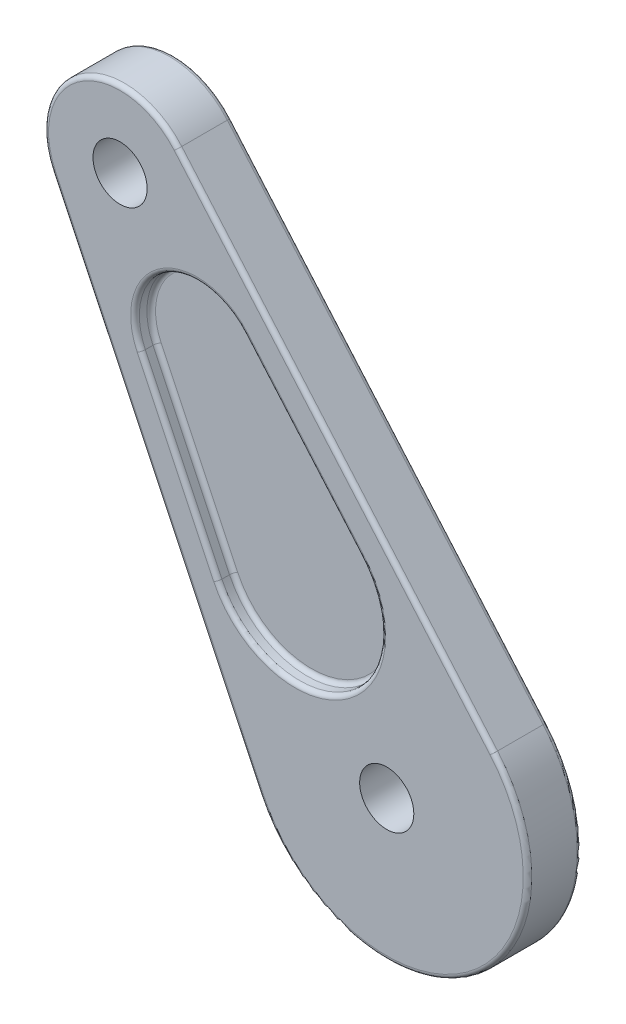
ISO-10303-21;
HEADER;
FILE_DESCRIPTION(('STEP AP214'),'2;1');
FILE_NAME('part.step','',(''),(''),'','','');
FILE_SCHEMA(('AUTOMOTIVE_DESIGN { 1 0 10303 214 1 1 1 1 }'));
ENDSEC;
DATA;
#1=APPLICATION_CONTEXT('core data for automotive mechanical design processes');
#2=APPLICATION_PROTOCOL_DEFINITION('international standard','automotive_design',2000,#1);
#3=PRODUCT_CONTEXT('',#1,'mechanical');
#4=PRODUCT('Part','Part','',(#3));
#5=PRODUCT_RELATED_PRODUCT_CATEGORY('part','',(#4));
#6=PRODUCT_DEFINITION_FORMATION('','',#4);
#7=PRODUCT_DEFINITION_CONTEXT('part definition',#1,'design');
#8=PRODUCT_DEFINITION('design','',#6,#7);
#9=PRODUCT_DEFINITION_SHAPE('','',#8);
#10=(LENGTH_UNIT() NAMED_UNIT(*) SI_UNIT(.MILLI.,.METRE.));
#11=(NAMED_UNIT(*) PLANE_ANGLE_UNIT() SI_UNIT($,.RADIAN.));
#12=(NAMED_UNIT(*) SI_UNIT($,.STERADIAN.) SOLID_ANGLE_UNIT());
#13=UNCERTAINTY_MEASURE_WITH_UNIT(LENGTH_MEASURE(1.E-05),#10,'distance_accuracy_value','');
#14=(GEOMETRIC_REPRESENTATION_CONTEXT(3) GLOBAL_UNCERTAINTY_ASSIGNED_CONTEXT((#13)) GLOBAL_UNIT_ASSIGNED_CONTEXT((#10,
#11,#12)) REPRESENTATION_CONTEXT('',''));
#15=CARTESIAN_POINT('',(0.,0.,0.));
#16=DIRECTION('',(0.,0.,1.));
#17=DIRECTION('',(1.,0.,0.));
#18=AXIS2_PLACEMENT_3D('',#15,#16,#17);
#19=CARTESIAN_POINT('',(-123.08554834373,188.347943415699,-12.5));
#20=DIRECTION('',(0.,0.,1.));
#21=DIRECTION('',(1.,0.,0.));
#22=AXIS2_PLACEMENT_3D('',#19,#20,#21);
#23=PLANE('',#22);
#24=CARTESIAN_POINT('',(-87.5275010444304,133.93631531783,-12.5));
#25=DIRECTION('',(0.,0.,1.));
#26=DIRECTION('',(1.,0.,0.));
#27=AXIS2_PLACEMENT_3D('',#24,#25,#26);
#28=CIRCLE('',#27,30.6666666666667);
#29=CARTESIAN_POINT('',(-64.3223989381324,153.985446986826,-12.5));
#30=VERTEX_POINT('',#29);
#31=CARTESIAN_POINT('',(-115.206230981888,120.732817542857,-12.5));
#32=VERTEX_POINT('',#31);
#33=EDGE_CURVE('E256',#30,#32,#28,.T.);
#34=ORIENTED_EDGE('',*,*,#33,.T.);
#35=DIRECTION('',(0.430548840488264,-0.902567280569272,0.));
#36=VECTOR('',#35,1.);
#37=CARTESIAN_POINT('',(-79.8776019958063,46.6727769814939,-12.5));
#38=LINE('',#37,#36);
#39=CARTESIAN_POINT('',(-79.8776019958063,46.6727769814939,-12.5));
#40=VERTEX_POINT('',#39);
#41=EDGE_CURVE('E258',#32,#40,#38,.T.);
#42=ORIENTED_EDGE('',*,*,#41,.T.);
#43=CARTESIAN_POINT('',(-42.2352371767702,64.6291962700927,-12.5));
#44=DIRECTION('',(0.,0.,1.));
#45=DIRECTION('',(1.,0.,0.));
#46=AXIS2_PLACEMENT_3D('',#43,#44,#45);
#47=CIRCLE('',#46,41.7058823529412);
#48=CARTESIAN_POINT('',(-10.6768917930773,91.8955025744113,-12.5));
#49=VERTEX_POINT('',#48);
#50=EDGE_CURVE('E252',#40,#49,#47,.T.);
#51=ORIENTED_EDGE('',*,*,#50,.T.);
#52=DIRECTION('',(-0.653776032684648,0.756688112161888,0.));
#53=VECTOR('',#52,1.);
#54=CARTESIAN_POINT('',(-64.3223989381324,153.985446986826,-12.5));
#55=LINE('',#54,#53);
#56=EDGE_CURVE('E254',#49,#30,#55,.T.);
#57=ORIENTED_EDGE('',*,*,#56,.T.);
#58=EDGE_LOOP('',(#34,#42,#51,#57));
#59=FACE_BOUND('',#58,.T.);
#60=CARTESIAN_POINT('',(-123.08554834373,188.347943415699,-12.5));
#61=DIRECTION('',(0.,0.,1.));
#62=DIRECTION('',(1.,0.,0.));
#63=AXIS2_PLACEMENT_3D('',#60,#61,#62);
#64=CIRCLE('',#63,12.5);
#65=CARTESIAN_POINT('',(-110.58554834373,188.347943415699,-12.5));
#66=VERTEX_POINT('',#65);
#67=EDGE_CURVE('E391',#66,#66,#64,.T.);
#68=ORIENTED_EDGE('',*,*,#67,.T.);
#69=EDGE_LOOP('',(#68));
#70=FACE_BOUND('',#69,.T.);
#71=CARTESIAN_POINT('',(0.,0.,-12.5));
#72=DIRECTION('',(0.,0.,1.));
#73=DIRECTION('',(1.,0.,0.));
#74=AXIS2_PLACEMENT_3D('',#71,#72,#73);
#75=CIRCLE('',#74,12.5);
#76=CARTESIAN_POINT('',(12.5,0.,-12.5));
#77=VERTEX_POINT('',#76);
#78=EDGE_CURVE('E390',#77,#77,#75,.T.);
#79=ORIENTED_EDGE('',*,*,#78,.T.);
#80=EDGE_LOOP('',(#79));
#81=FACE_BOUND('',#80,.T.);
#82=DIRECTION('',(-0.653776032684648,0.756688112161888,0.));
#83=VECTOR('',#82,1.);
#84=CARTESIAN_POINT('',(-98.1148406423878,209.922552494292,-12.5));
#85=LINE('',#84,#83);
#86=CARTESIAN_POINT('',(-98.1148406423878,209.922552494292,-12.5));
#87=VERTEX_POINT('',#86);
#88=CARTESIAN_POINT('',(47.671351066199,41.1878900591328,-12.5));
#89=VERTEX_POINT('',#88);
#90=EDGE_CURVE('E404',#87,#89,#85,.F.);
#91=ORIENTED_EDGE('',*,*,#90,.T.);
#92=CARTESIAN_POINT('',(0.,0.,-12.5));
#93=DIRECTION('',(0.,0.,1.));
#94=DIRECTION('',(1.,0.,0.));
#95=AXIS2_PLACEMENT_3D('',#92,#93,#94);
#96=CIRCLE('',#95,63.);
#97=CARTESIAN_POINT('',(-56.8617386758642,-27.1245769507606,-12.5));
#98=VERTEX_POINT('',#97);
#99=EDGE_CURVE('E410',#89,#98,#96,.F.);
#100=ORIENTED_EDGE('',*,*,#99,.T.);
#101=DIRECTION('',(0.430548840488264,-0.902567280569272,0.));
#102=VECTOR('',#101,1.);
#103=CARTESIAN_POINT('',(-152.870268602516,174.139831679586,-12.5));
#104=LINE('',#103,#102);
#105=CARTESIAN_POINT('',(-152.870268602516,174.139831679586,-12.5));
#106=VERTEX_POINT('',#105);
#107=EDGE_CURVE('E408',#98,#106,#104,.F.);
#108=ORIENTED_EDGE('',*,*,#107,.T.);
#109=CARTESIAN_POINT('',(-123.08554834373,188.347943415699,-12.5));
#110=DIRECTION('',(0.,0.,1.));
#111=DIRECTION('',(1.,0.,0.));
#112=AXIS2_PLACEMENT_3D('',#109,#110,#111);
#113=CIRCLE('',#112,33.);
#114=EDGE_CURVE('E406',#106,#87,#113,.F.);
#115=ORIENTED_EDGE('',*,*,#114,.T.);
#116=EDGE_LOOP('',(#91,#100,#108,#115));
#117=FACE_BOUND('',#116,.T.);
#118=ADVANCED_FACE('F34',(#59,#70,#81,#117),#23,.F.);
#119=CARTESIAN_POINT('',(-123.08554834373,188.347943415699,12.5));
#120=DIRECTION('',(0.,0.,1.));
#121=DIRECTION('',(1.,0.,0.));
#122=AXIS2_PLACEMENT_3D('',#119,#120,#121);
#123=PLANE('',#122);
#124=CARTESIAN_POINT('',(-42.2352371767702,64.6291962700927,12.5));
#125=DIRECTION('',(0.,0.,1.));
#126=DIRECTION('',(1.,0.,0.));
#127=AXIS2_PLACEMENT_3D('',#124,#125,#126);
#128=CIRCLE('',#127,41.7058823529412);
#129=CARTESIAN_POINT('',(-10.6768917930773,91.8955025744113,12.5));
#130=VERTEX_POINT('',#129);
#131=CARTESIAN_POINT('',(-79.8776019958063,46.6727769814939,12.5));
#132=VERTEX_POINT('',#131);
#133=EDGE_CURVE('E288',#130,#132,#128,.F.);
#134=ORIENTED_EDGE('',*,*,#133,.T.);
#135=DIRECTION('',(0.430548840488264,-0.902567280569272,0.));
#136=VECTOR('',#135,1.);
#137=CARTESIAN_POINT('',(-115.206230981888,120.732817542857,12.5));
#138=LINE('',#137,#136);
#139=CARTESIAN_POINT('',(-115.206230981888,120.732817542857,12.5));
#140=VERTEX_POINT('',#139);
#141=EDGE_CURVE('E290',#132,#140,#138,.F.);
#142=ORIENTED_EDGE('',*,*,#141,.T.);
#143=CARTESIAN_POINT('',(-87.5275010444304,133.93631531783,12.5));
#144=DIRECTION('',(0.,0.,1.));
#145=DIRECTION('',(1.,0.,0.));
#146=AXIS2_PLACEMENT_3D('',#143,#144,#145);
#147=CIRCLE('',#146,30.6666666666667);
#148=CARTESIAN_POINT('',(-64.3223989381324,153.985446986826,12.5));
#149=VERTEX_POINT('',#148);
#150=EDGE_CURVE('E284',#140,#149,#147,.F.);
#151=ORIENTED_EDGE('',*,*,#150,.T.);
#152=DIRECTION('',(-0.653776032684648,0.756688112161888,0.));
#153=VECTOR('',#152,1.);
#154=CARTESIAN_POINT('',(-10.6768917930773,91.8955025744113,12.5));
#155=LINE('',#154,#153);
#156=EDGE_CURVE('E286',#149,#130,#155,.F.);
#157=ORIENTED_EDGE('',*,*,#156,.T.);
#158=EDGE_LOOP('',(#134,#142,#151,#157));
#159=FACE_BOUND('',#158,.T.);
#160=DIRECTION('',(0.430548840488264,-0.902567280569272,0.));
#161=VECTOR('',#160,1.);
#162=CARTESIAN_POINT('',(-56.8617386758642,-27.1245769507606,12.5));
#163=LINE('',#162,#161);
#164=CARTESIAN_POINT('',(-152.870268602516,174.139831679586,12.5));
#165=VERTEX_POINT('',#164);
#166=CARTESIAN_POINT('',(-56.8617386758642,-27.1245769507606,12.5));
#167=VERTEX_POINT('',#166);
#168=EDGE_CURVE('E424',#165,#167,#163,.T.);
#169=ORIENTED_EDGE('',*,*,#168,.T.);
#170=CARTESIAN_POINT('',(0.,0.,12.5));
#171=DIRECTION('',(0.,0.,1.));
#172=DIRECTION('',(1.,0.,0.));
#173=AXIS2_PLACEMENT_3D('',#170,#171,#172);
#174=CIRCLE('',#173,63.);
#175=CARTESIAN_POINT('',(47.671351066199,41.1878900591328,12.5));
#176=VERTEX_POINT('',#175);
#177=EDGE_CURVE('E209',#167,#176,#174,.T.);
#178=ORIENTED_EDGE('',*,*,#177,.T.);
#179=DIRECTION('',(-0.653776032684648,0.756688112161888,0.));
#180=VECTOR('',#179,1.);
#181=CARTESIAN_POINT('',(-98.1148406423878,209.922552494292,12.5));
#182=LINE('',#181,#180);
#183=CARTESIAN_POINT('',(-98.1148406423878,209.922552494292,12.5));
#184=VERTEX_POINT('',#183);
#185=EDGE_CURVE('E234',#176,#184,#182,.T.);
#186=ORIENTED_EDGE('',*,*,#185,.T.);
#187=CARTESIAN_POINT('',(-123.08554834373,188.347943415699,12.5));
#188=DIRECTION('',(0.,0.,1.));
#189=DIRECTION('',(1.,0.,0.));
#190=AXIS2_PLACEMENT_3D('',#187,#188,#189);
#191=CIRCLE('',#190,33.);
#192=EDGE_CURVE('E422',#184,#165,#191,.T.);
#193=ORIENTED_EDGE('',*,*,#192,.T.);
#194=EDGE_LOOP('',(#169,#178,#186,#193));
#195=FACE_BOUND('',#194,.T.);
#196=CARTESIAN_POINT('',(0.,0.,12.5));
#197=DIRECTION('',(0.,0.,1.));
#198=DIRECTION('',(1.,0.,0.));
#199=AXIS2_PLACEMENT_3D('',#196,#197,#198);
#200=CIRCLE('',#199,12.5);
#201=CARTESIAN_POINT('',(12.5,0.,12.5));
#202=VERTEX_POINT('',#201);
#203=EDGE_CURVE('E394',#202,#202,#200,.T.);
#204=ORIENTED_EDGE('',*,*,#203,.F.);
#205=EDGE_LOOP('',(#204));
#206=FACE_BOUND('',#205,.T.);
#207=CARTESIAN_POINT('',(-123.08554834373,188.347943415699,12.5));
#208=DIRECTION('',(0.,0.,1.));
#209=DIRECTION('',(1.,0.,0.));
#210=AXIS2_PLACEMENT_3D('',#207,#208,#209);
#211=CIRCLE('',#210,12.5);
#212=CARTESIAN_POINT('',(-110.58554834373,188.347943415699,12.5));
#213=VERTEX_POINT('',#212);
#214=EDGE_CURVE('E387',#213,#213,#211,.T.);
#215=ORIENTED_EDGE('',*,*,#214,.F.);
#216=EDGE_LOOP('',(#215));
#217=FACE_BOUND('',#216,.T.);
#218=ADVANCED_FACE('F465',(#159,#195,#206,#217),#123,.T.);
#219=CARTESIAN_POINT('',(-123.08554834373,188.347943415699,12.5));
#220=DIRECTION('',(0.,0.,-1.));
#221=DIRECTION('',(-1.,0.,0.));
#222=AXIS2_PLACEMENT_3D('',#219,#220,#221);
#223=CYLINDRICAL_SURFACE('',#222,35.);
#224=DIRECTION('',(0.,0.,-1.));
#225=VECTOR('',#224,1.);
#226=CARTESIAN_POINT('',(-96.6014644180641,211.230104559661,12.5));
#227=LINE('',#226,#225);
#228=CARTESIAN_POINT('',(-96.6014644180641,211.230104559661,10.5));
#229=VERTEX_POINT('',#228);
#230=CARTESIAN_POINT('',(-96.6014644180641,211.230104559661,-10.5));
#231=VERTEX_POINT('',#230);
#232=EDGE_CURVE('E203',#229,#231,#227,.T.);
#233=ORIENTED_EDGE('',*,*,#232,.T.);
#234=CARTESIAN_POINT('',(-123.08554834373,188.347943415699,-10.5));
#235=DIRECTION('',(0.,0.,1.));
#236=DIRECTION('',(1.,0.,0.));
#237=AXIS2_PLACEMENT_3D('',#234,#235,#236);
#238=CIRCLE('',#237,35.);
#239=CARTESIAN_POINT('',(-154.675403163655,173.278733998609,-10.5));
#240=VERTEX_POINT('',#239);
#241=EDGE_CURVE('E419',#231,#240,#238,.T.);
#242=ORIENTED_EDGE('',*,*,#241,.T.);
#243=DIRECTION('',(0.,0.,-1.));
#244=VECTOR('',#243,1.);
#245=CARTESIAN_POINT('',(-154.675403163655,173.278733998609,12.5));
#246=LINE('',#245,#244);
#247=CARTESIAN_POINT('',(-154.675403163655,173.278733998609,10.5));
#248=VERTEX_POINT('',#247);
#249=EDGE_CURVE('E231',#248,#240,#246,.T.);
#250=ORIENTED_EDGE('',*,*,#249,.F.);
#251=CARTESIAN_POINT('',(-123.08554834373,188.347943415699,10.5));
#252=DIRECTION('',(0.,0.,1.));
#253=DIRECTION('',(1.,0.,0.));
#254=AXIS2_PLACEMENT_3D('',#251,#252,#253);
#255=CIRCLE('',#254,35.);
#256=EDGE_CURVE('E417',#248,#229,#255,.F.);
#257=ORIENTED_EDGE('',*,*,#256,.T.);
#258=EDGE_LOOP('',(#233,#242,#250,#257));
#259=FACE_BOUND('',#258,.T.);
#260=ADVANCED_FACE('F454',(#259),#223,.T.);
#261=CARTESIAN_POINT('',(-154.675403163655,173.278733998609,12.5));
#262=DIRECTION('',(0.902567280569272,0.430548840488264,0.));
#263=DIRECTION('',(-0.430548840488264,0.902567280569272,0.));
#264=AXIS2_PLACEMENT_3D('',#261,#262,#263);
#265=PLANE('',#264);
#266=ORIENTED_EDGE('',*,*,#249,.T.);
#267=DIRECTION('',(0.430548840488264,-0.902567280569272,0.));
#268=VECTOR('',#267,1.);
#269=CARTESIAN_POINT('',(-154.675403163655,173.278733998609,-10.5));
#270=LINE('',#269,#268);
#271=CARTESIAN_POINT('',(-58.6668732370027,-27.9856746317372,-10.5));
#272=VERTEX_POINT('',#271);
#273=EDGE_CURVE('E415',#240,#272,#270,.T.);
#274=ORIENTED_EDGE('',*,*,#273,.T.);
#275=DIRECTION('',(0.,0.,-1.));
#276=VECTOR('',#275,1.);
#277=CARTESIAN_POINT('',(-58.6668732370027,-27.9856746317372,12.5));
#278=LINE('',#277,#276);
#279=CARTESIAN_POINT('',(-58.6668732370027,-27.9856746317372,10.5));
#280=VERTEX_POINT('',#279);
#281=EDGE_CURVE('E221',#280,#272,#278,.T.);
#282=ORIENTED_EDGE('',*,*,#281,.F.);
#283=DIRECTION('',(0.430548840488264,-0.902567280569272,0.));
#284=VECTOR('',#283,1.);
#285=CARTESIAN_POINT('',(-154.675403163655,173.278733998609,10.5));
#286=LINE('',#285,#284);
#287=EDGE_CURVE('E413',#280,#248,#286,.F.);
#288=ORIENTED_EDGE('',*,*,#287,.T.);
#289=EDGE_LOOP('',(#266,#274,#282,#288));
#290=FACE_BOUND('',#289,.T.);
#291=ADVANCED_FACE('F498',(#290),#265,.F.);
#292=CARTESIAN_POINT('',(0.,0.,12.5));
#293=DIRECTION('',(0.,0.,-1.));
#294=DIRECTION('',(-1.,0.,0.));
#295=AXIS2_PLACEMENT_3D('',#292,#293,#294);
#296=CYLINDRICAL_SURFACE('',#295,65.);
#297=ORIENTED_EDGE('',*,*,#281,.T.);
#298=CARTESIAN_POINT('',(0.,0.,-10.5));
#299=DIRECTION('',(0.,0.,1.));
#300=DIRECTION('',(1.,0.,0.));
#301=AXIS2_PLACEMENT_3D('',#298,#299,#300);
#302=CIRCLE('',#301,65.);
#303=CARTESIAN_POINT('',(49.1847272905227,42.4954421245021,-10.5));
#304=VERTEX_POINT('',#303);
#305=EDGE_CURVE('E220',#272,#304,#302,.T.);
#306=ORIENTED_EDGE('',*,*,#305,.T.);
#307=DIRECTION('',(0.,0.,-1.));
#308=VECTOR('',#307,1.);
#309=CARTESIAN_POINT('',(49.1847272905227,42.4954421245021,12.5));
#310=LINE('',#309,#308);
#311=CARTESIAN_POINT('',(49.1847272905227,42.4954421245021,10.5));
#312=VERTEX_POINT('',#311);
#313=EDGE_CURVE('E201',#312,#304,#310,.T.);
#314=ORIENTED_EDGE('',*,*,#313,.F.);
#315=CARTESIAN_POINT('',(0.,0.,10.5));
#316=DIRECTION('',(0.,0.,1.));
#317=DIRECTION('',(1.,0.,0.));
#318=AXIS2_PLACEMENT_3D('',#315,#316,#317);
#319=CIRCLE('',#318,65.);
#320=EDGE_CURVE('E217',#312,#280,#319,.F.);
#321=ORIENTED_EDGE('',*,*,#320,.T.);
#322=EDGE_LOOP('',(#297,#306,#314,#321));
#323=FACE_BOUND('',#322,.T.);
#324=ADVANCED_FACE('F216',(#323),#296,.T.);
#325=CARTESIAN_POINT('',(-96.6014644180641,211.230104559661,12.5));
#326=DIRECTION('',(-0.756688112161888,-0.653776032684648,0.));
#327=DIRECTION('',(0.653776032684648,-0.756688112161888,0.));
#328=AXIS2_PLACEMENT_3D('',#325,#326,#327);
#329=PLANE('',#328);
#330=ORIENTED_EDGE('',*,*,#313,.T.);
#331=DIRECTION('',(-0.653776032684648,0.756688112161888,0.));
#332=VECTOR('',#331,1.);
#333=CARTESIAN_POINT('',(-96.6014644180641,211.230104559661,-10.5));
#334=LINE('',#333,#332);
#335=EDGE_CURVE('E208',#304,#231,#334,.T.);
#336=ORIENTED_EDGE('',*,*,#335,.T.);
#337=ORIENTED_EDGE('',*,*,#232,.F.);
#338=DIRECTION('',(-0.653776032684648,0.756688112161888,0.));
#339=VECTOR('',#338,1.);
#340=CARTESIAN_POINT('',(49.1847272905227,42.4954421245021,10.5));
#341=LINE('',#340,#339);
#342=EDGE_CURVE('E198',#229,#312,#341,.F.);
#343=ORIENTED_EDGE('',*,*,#342,.T.);
#344=EDGE_LOOP('',(#330,#336,#337,#343));
#345=FACE_BOUND('',#344,.T.);
#346=ADVANCED_FACE('F200',(#345),#329,.F.);
#347=CARTESIAN_POINT('',(0.,0.,12.5));
#348=DIRECTION('',(0.,0.,-1.));
#349=DIRECTION('',(-1.,0.,0.));
#350=AXIS2_PLACEMENT_3D('',#347,#348,#349);
#351=CYLINDRICAL_SURFACE('',#350,12.5);
#352=ORIENTED_EDGE('',*,*,#203,.T.);
#353=EDGE_LOOP('',(#352));
#354=FACE_BOUND('',#353,.T.);
#355=ORIENTED_EDGE('',*,*,#78,.F.);
#356=EDGE_LOOP('',(#355));
#357=FACE_BOUND('',#356,.T.);
#358=ADVANCED_FACE('F477',(#354,#357),#351,.F.);
#359=CARTESIAN_POINT('',(-123.08554834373,188.347943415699,12.5));
#360=DIRECTION('',(0.,0.,-1.));
#361=DIRECTION('',(-1.,0.,0.));
#362=AXIS2_PLACEMENT_3D('',#359,#360,#361);
#363=CYLINDRICAL_SURFACE('',#362,12.5);
#364=ORIENTED_EDGE('',*,*,#214,.T.);
#365=EDGE_LOOP('',(#364));
#366=FACE_BOUND('',#365,.T.);
#367=ORIENTED_EDGE('',*,*,#67,.F.);
#368=EDGE_LOOP('',(#367));
#369=FACE_BOUND('',#368,.T.);
#370=ADVANCED_FACE('F474',(#366,#369),#363,.F.);
#371=CARTESIAN_POINT('',(-123.08554834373,188.347943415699,-10.5));
#372=DIRECTION('',(0.,0.,1.));
#373=DIRECTION('',(1.,0.,0.));
#374=AXIS2_PLACEMENT_3D('',#371,#372,#373);
#375=TOROIDAL_SURFACE('',#374,33.,2.);
#376=CARTESIAN_POINT('',(-98.1148406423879,209.922552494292,-10.5));
#377=DIRECTION('',(0.653776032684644,-0.756688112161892,0.));
#378=DIRECTION('',(0.756688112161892,0.653776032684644,0.));
#379=AXIS2_PLACEMENT_3D('',#376,#377,#378);
#380=CIRCLE('',#379,2.);
#381=EDGE_CURVE('E430',#87,#231,#380,.T.);
#382=ORIENTED_EDGE('',*,*,#381,.F.);
#383=ORIENTED_EDGE('',*,*,#114,.F.);
#384=CARTESIAN_POINT('',(-152.870268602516,174.139831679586,-10.5));
#385=DIRECTION('',(0.430548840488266,-0.902567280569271,0.));
#386=DIRECTION('',(0.902567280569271,0.430548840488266,0.));
#387=AXIS2_PLACEMENT_3D('',#384,#385,#386);
#388=CIRCLE('',#387,2.);
#389=EDGE_CURVE('E244',#240,#106,#388,.T.);
#390=ORIENTED_EDGE('',*,*,#389,.F.);
#391=ORIENTED_EDGE('',*,*,#241,.F.);
#392=EDGE_LOOP('',(#382,#383,#390,#391));
#393=FACE_BOUND('',#392,.T.);
#394=ADVANCED_FACE('F446',(#393),#375,.T.);
#395=CARTESIAN_POINT('',(-152.870268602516,174.139831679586,-10.5));
#396=DIRECTION('',(0.430548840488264,-0.902567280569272,0.));
#397=DIRECTION('',(0.902567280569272,0.430548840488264,0.));
#398=AXIS2_PLACEMENT_3D('',#395,#396,#397);
#399=CYLINDRICAL_SURFACE('',#398,2.);
#400=ORIENTED_EDGE('',*,*,#389,.T.);
#401=ORIENTED_EDGE('',*,*,#107,.F.);
#402=CARTESIAN_POINT('',(-56.8617386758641,-27.1245769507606,-10.5));
#403=DIRECTION('',(0.430548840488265,-0.902567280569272,0.));
#404=DIRECTION('',(0.902567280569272,0.430548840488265,0.));
#405=AXIS2_PLACEMENT_3D('',#402,#403,#404);
#406=CIRCLE('',#405,2.);
#407=EDGE_CURVE('E429',#272,#98,#406,.T.);
#408=ORIENTED_EDGE('',*,*,#407,.F.);
#409=ORIENTED_EDGE('',*,*,#273,.F.);
#410=EDGE_LOOP('',(#400,#401,#408,#409));
#411=FACE_BOUND('',#410,.T.);
#412=ADVANCED_FACE('F441',(#411),#399,.T.);
#413=CARTESIAN_POINT('',(-98.1148406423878,209.922552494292,-10.5));
#414=DIRECTION('',(-0.653776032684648,0.756688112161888,0.));
#415=DIRECTION('',(-0.756688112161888,-0.653776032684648,0.));
#416=AXIS2_PLACEMENT_3D('',#413,#414,#415);
#417=CYLINDRICAL_SURFACE('',#416,2.);
#418=ORIENTED_EDGE('',*,*,#381,.T.);
#419=ORIENTED_EDGE('',*,*,#335,.F.);
#420=CARTESIAN_POINT('',(47.671351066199,41.1878900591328,-10.5));
#421=DIRECTION('',(0.653776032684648,-0.756688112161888,0.));
#422=DIRECTION('',(0.756688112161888,0.653776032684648,0.));
#423=AXIS2_PLACEMENT_3D('',#420,#421,#422);
#424=CIRCLE('',#423,2.);
#425=EDGE_CURVE('E251',#89,#304,#424,.T.);
#426=ORIENTED_EDGE('',*,*,#425,.F.);
#427=ORIENTED_EDGE('',*,*,#90,.F.);
#428=EDGE_LOOP('',(#418,#419,#426,#427));
#429=FACE_BOUND('',#428,.T.);
#430=ADVANCED_FACE('F452',(#429),#417,.T.);
#431=CARTESIAN_POINT('',(0.,0.,-10.5));
#432=DIRECTION('',(0.,0.,1.));
#433=DIRECTION('',(1.,0.,0.));
#434=AXIS2_PLACEMENT_3D('',#431,#432,#433);
#435=TOROIDAL_SURFACE('',#434,63.,2.);
#436=ORIENTED_EDGE('',*,*,#407,.T.);
#437=ORIENTED_EDGE('',*,*,#99,.F.);
#438=ORIENTED_EDGE('',*,*,#425,.T.);
#439=ORIENTED_EDGE('',*,*,#305,.F.);
#440=EDGE_LOOP('',(#436,#437,#438,#439));
#441=FACE_BOUND('',#440,.T.);
#442=ADVANCED_FACE('F451',(#441),#435,.T.);
#443=CARTESIAN_POINT('',(-123.08554834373,188.347943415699,10.5));
#444=DIRECTION('',(0.,0.,1.));
#445=DIRECTION('',(1.,0.,0.));
#446=AXIS2_PLACEMENT_3D('',#443,#444,#445);
#447=TOROIDAL_SURFACE('',#446,33.,2.);
#448=CARTESIAN_POINT('',(-98.1148406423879,209.922552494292,10.5));
#449=DIRECTION('',(0.653776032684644,-0.756688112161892,0.));
#450=DIRECTION('',(0.756688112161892,0.653776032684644,0.));
#451=AXIS2_PLACEMENT_3D('',#448,#449,#450);
#452=CIRCLE('',#451,2.);
#453=EDGE_CURVE('E238',#229,#184,#452,.T.);
#454=ORIENTED_EDGE('',*,*,#453,.F.);
#455=ORIENTED_EDGE('',*,*,#256,.F.);
#456=CARTESIAN_POINT('',(-152.870268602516,174.139831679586,10.5));
#457=DIRECTION('',(0.430548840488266,-0.902567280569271,0.));
#458=DIRECTION('',(0.902567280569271,0.430548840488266,0.));
#459=AXIS2_PLACEMENT_3D('',#456,#457,#458);
#460=CIRCLE('',#459,2.);
#461=EDGE_CURVE('E248',#165,#248,#460,.T.);
#462=ORIENTED_EDGE('',*,*,#461,.F.);
#463=ORIENTED_EDGE('',*,*,#192,.F.);
#464=EDGE_LOOP('',(#454,#455,#462,#463));
#465=FACE_BOUND('',#464,.T.);
#466=ADVANCED_FACE('F459',(#465),#447,.T.);
#467=CARTESIAN_POINT('',(-152.870268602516,174.139831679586,10.5));
#468=DIRECTION('',(-0.430548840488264,0.902567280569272,0.));
#469=DIRECTION('',(-0.902567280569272,-0.430548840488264,0.));
#470=AXIS2_PLACEMENT_3D('',#467,#468,#469);
#471=CYLINDRICAL_SURFACE('',#470,2.);
#472=ORIENTED_EDGE('',*,*,#461,.T.);
#473=ORIENTED_EDGE('',*,*,#287,.F.);
#474=CARTESIAN_POINT('',(-56.8617386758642,-27.1245769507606,10.5));
#475=DIRECTION('',(0.430548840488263,-0.902567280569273,0.));
#476=DIRECTION('',(0.902567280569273,0.430548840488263,0.));
#477=AXIS2_PLACEMENT_3D('',#474,#475,#476);
#478=CIRCLE('',#477,2.);
#479=EDGE_CURVE('E229',#167,#280,#478,.T.);
#480=ORIENTED_EDGE('',*,*,#479,.F.);
#481=ORIENTED_EDGE('',*,*,#168,.F.);
#482=EDGE_LOOP('',(#472,#473,#480,#481));
#483=FACE_BOUND('',#482,.T.);
#484=ADVANCED_FACE('F463',(#483),#471,.T.);
#485=CARTESIAN_POINT('',(-98.1148406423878,209.922552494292,10.5));
#486=DIRECTION('',(0.653776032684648,-0.756688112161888,0.));
#487=DIRECTION('',(0.756688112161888,0.653776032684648,0.));
#488=AXIS2_PLACEMENT_3D('',#485,#486,#487);
#489=CYLINDRICAL_SURFACE('',#488,2.);
#490=ORIENTED_EDGE('',*,*,#453,.T.);
#491=ORIENTED_EDGE('',*,*,#185,.F.);
#492=CARTESIAN_POINT('',(47.671351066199,41.1878900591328,10.5));
#493=DIRECTION('',(0.653776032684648,-0.756688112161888,0.));
#494=DIRECTION('',(0.756688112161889,0.653776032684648,0.));
#495=AXIS2_PLACEMENT_3D('',#492,#493,#494);
#496=CIRCLE('',#495,2.);
#497=EDGE_CURVE('E226',#312,#176,#496,.T.);
#498=ORIENTED_EDGE('',*,*,#497,.F.);
#499=ORIENTED_EDGE('',*,*,#342,.F.);
#500=EDGE_LOOP('',(#490,#491,#498,#499));
#501=FACE_BOUND('',#500,.T.);
#502=ADVANCED_FACE('F233',(#501),#489,.T.);
#503=CARTESIAN_POINT('',(0.,0.,10.5));
#504=DIRECTION('',(0.,0.,1.));
#505=DIRECTION('',(1.,0.,0.));
#506=AXIS2_PLACEMENT_3D('',#503,#504,#505);
#507=TOROIDAL_SURFACE('',#506,63.,2.);
#508=ORIENTED_EDGE('',*,*,#479,.T.);
#509=ORIENTED_EDGE('',*,*,#320,.F.);
#510=ORIENTED_EDGE('',*,*,#497,.T.);
#511=ORIENTED_EDGE('',*,*,#177,.F.);
#512=EDGE_LOOP('',(#508,#509,#510,#511));
#513=FACE_BOUND('',#512,.T.);
#514=ADVANCED_FACE('F224',(#513),#507,.T.);
#515=CARTESIAN_POINT('',(24.0308841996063,-166.507218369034,5.));
#516=DIRECTION('',(-0.902567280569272,-0.430548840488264,0.));
#517=DIRECTION('',(0.430548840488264,-0.902567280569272,0.));
#518=AXIS2_PLACEMENT_3D('',#515,#516,#517);
#519=PLANE('',#518);
#520=DIRECTION('',(0.,0.,1.));
#521=VECTOR('',#520,1.);
#522=CARTESIAN_POINT('',(-113.40109642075,121.593915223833,5.));
#523=LINE('',#522,#521);
#524=CARTESIAN_POINT('',(-113.40109642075,121.593915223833,7.));
#525=VERTEX_POINT('',#524);
#526=CARTESIAN_POINT('',(-113.40109642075,121.593915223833,10.5));
#527=VERTEX_POINT('',#526);
#528=EDGE_CURVE('E236',#525,#527,#523,.T.);
#529=ORIENTED_EDGE('',*,*,#528,.T.);
#530=DIRECTION('',(0.430548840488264,-0.902567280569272,0.));
#531=VECTOR('',#530,1.);
#532=CARTESIAN_POINT('',(-78.0724674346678,47.5338746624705,10.5));
#533=LINE('',#532,#531);
#534=CARTESIAN_POINT('',(-78.0724674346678,47.5338746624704,10.5));
#535=VERTEX_POINT('',#534);
#536=EDGE_CURVE('E281',#527,#535,#533,.T.);
#537=ORIENTED_EDGE('',*,*,#536,.T.);
#538=DIRECTION('',(0.,0.,1.));
#539=VECTOR('',#538,1.);
#540=CARTESIAN_POINT('',(-78.0724674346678,47.5338746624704,5.));
#541=LINE('',#540,#539);
#542=CARTESIAN_POINT('',(-78.0724674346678,47.5338746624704,7.));
#543=VERTEX_POINT('',#542);
#544=EDGE_CURVE('E380',#543,#535,#541,.T.);
#545=ORIENTED_EDGE('',*,*,#544,.F.);
#546=DIRECTION('',(0.430548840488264,-0.902567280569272,0.));
#547=VECTOR('',#546,1.);
#548=CARTESIAN_POINT('',(24.0308841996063,-166.507218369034,7.));
#549=LINE('',#548,#547);
#550=EDGE_CURVE('E279',#543,#525,#549,.F.);
#551=ORIENTED_EDGE('',*,*,#550,.T.);
#552=EDGE_LOOP('',(#529,#537,#545,#551));
#553=FACE_BOUND('',#552,.T.);
#554=ADVANCED_FACE('F514',(#553),#519,.F.);
#555=CARTESIAN_POINT('',(-87.5275010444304,133.93631531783,5.));
#556=DIRECTION('',(0.,0.,1.));
#557=DIRECTION('',(1.,0.,0.));
#558=AXIS2_PLACEMENT_3D('',#555,#556,#557);
#559=CYLINDRICAL_SURFACE('',#558,28.6666666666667);
#560=DIRECTION('',(0.,0.,1.));
#561=VECTOR('',#560,1.);
#562=CARTESIAN_POINT('',(-65.8357751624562,152.677894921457,5.));
#563=LINE('',#562,#561);
#564=CARTESIAN_POINT('',(-65.8357751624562,152.677894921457,7.));
#565=VERTEX_POINT('',#564);
#566=CARTESIAN_POINT('',(-65.8357751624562,152.677894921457,10.5));
#567=VERTEX_POINT('',#566);
#568=EDGE_CURVE('E241',#565,#567,#563,.T.);
#569=ORIENTED_EDGE('',*,*,#568,.T.);
#570=CARTESIAN_POINT('',(-87.5275010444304,133.93631531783,10.5));
#571=DIRECTION('',(0.,0.,1.));
#572=DIRECTION('',(1.,0.,0.));
#573=AXIS2_PLACEMENT_3D('',#570,#571,#572);
#574=CIRCLE('',#573,28.6666666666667);
#575=EDGE_CURVE('E304',#567,#527,#574,.T.);
#576=ORIENTED_EDGE('',*,*,#575,.T.);
#577=ORIENTED_EDGE('',*,*,#528,.F.);
#578=CARTESIAN_POINT('',(-87.5275010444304,133.93631531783,7.));
#579=DIRECTION('',(0.,0.,1.));
#580=DIRECTION('',(1.,0.,0.));
#581=AXIS2_PLACEMENT_3D('',#578,#579,#580);
#582=CIRCLE('',#581,28.6666666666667);
#583=EDGE_CURVE('E302',#525,#565,#582,.F.);
#584=ORIENTED_EDGE('',*,*,#583,.T.);
#585=EDGE_LOOP('',(#569,#576,#577,#584));
#586=FACE_BOUND('',#585,.T.);
#587=ADVANCED_FACE('F371',(#586),#559,.F.);
#588=CARTESIAN_POINT('',(116.967319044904,-58.900568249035,5.));
#589=DIRECTION('',(0.756688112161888,0.653776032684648,0.));
#590=DIRECTION('',(-0.653776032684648,0.756688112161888,0.));
#591=AXIS2_PLACEMENT_3D('',#588,#589,#590);
#592=PLANE('',#591);
#593=DIRECTION('',(0.,0.,1.));
#594=VECTOR('',#593,1.);
#595=CARTESIAN_POINT('',(-12.1902680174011,90.587950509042,5.));
#596=LINE('',#595,#594);
#597=CARTESIAN_POINT('',(-12.1902680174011,90.587950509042,7.));
#598=VERTEX_POINT('',#597);
#599=CARTESIAN_POINT('',(-12.1902680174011,90.587950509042,10.5));
#600=VERTEX_POINT('',#599);
#601=EDGE_CURVE('E378',#598,#600,#596,.T.);
#602=ORIENTED_EDGE('',*,*,#601,.T.);
#603=DIRECTION('',(-0.653776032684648,0.756688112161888,0.));
#604=VECTOR('',#603,1.);
#605=CARTESIAN_POINT('',(-65.8357751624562,152.677894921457,10.5));
#606=LINE('',#605,#604);
#607=EDGE_CURVE('E300',#600,#567,#606,.T.);
#608=ORIENTED_EDGE('',*,*,#607,.T.);
#609=ORIENTED_EDGE('',*,*,#568,.F.);
#610=DIRECTION('',(-0.653776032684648,0.756688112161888,0.));
#611=VECTOR('',#610,1.);
#612=CARTESIAN_POINT('',(116.967319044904,-58.900568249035,7.));
#613=LINE('',#612,#611);
#614=EDGE_CURVE('E298',#565,#598,#613,.F.);
#615=ORIENTED_EDGE('',*,*,#614,.T.);
#616=EDGE_LOOP('',(#602,#608,#609,#615));
#617=FACE_BOUND('',#616,.T.);
#618=ADVANCED_FACE('F375',(#617),#592,.F.);
#619=CARTESIAN_POINT('',(-42.2352371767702,64.6291962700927,5.));
#620=DIRECTION('',(0.,0.,1.));
#621=DIRECTION('',(1.,0.,0.));
#622=AXIS2_PLACEMENT_3D('',#619,#620,#621);
#623=CYLINDRICAL_SURFACE('',#622,39.7058823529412);
#624=ORIENTED_EDGE('',*,*,#544,.T.);
#625=CARTESIAN_POINT('',(-42.2352371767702,64.6291962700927,10.5));
#626=DIRECTION('',(0.,0.,1.));
#627=DIRECTION('',(1.,0.,0.));
#628=AXIS2_PLACEMENT_3D('',#625,#626,#627);
#629=CIRCLE('',#628,39.7058823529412);
#630=EDGE_CURVE('E296',#535,#600,#629,.T.);
#631=ORIENTED_EDGE('',*,*,#630,.T.);
#632=ORIENTED_EDGE('',*,*,#601,.F.);
#633=CARTESIAN_POINT('',(-42.2352371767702,64.6291962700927,7.));
#634=DIRECTION('',(0.,0.,1.));
#635=DIRECTION('',(1.,0.,0.));
#636=AXIS2_PLACEMENT_3D('',#633,#634,#635);
#637=CIRCLE('',#636,39.7058823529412);
#638=EDGE_CURVE('E293',#598,#543,#637,.F.);
#639=ORIENTED_EDGE('',*,*,#638,.T.);
#640=EDGE_LOOP('',(#624,#631,#632,#639));
#641=FACE_BOUND('',#640,.T.);
#642=ADVANCED_FACE('F675',(#641),#623,.F.);
#643=CARTESIAN_POINT('',(-46.5427741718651,-200.172749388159,5.));
#644=DIRECTION('',(0.,0.,1.));
#645=DIRECTION('',(1.,0.,0.));
#646=AXIS2_PLACEMENT_3D('',#643,#644,#645);
#647=PLANE('',#646);
#648=DIRECTION('',(0.430548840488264,-0.902567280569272,0.));
#649=VECTOR('',#648,1.);
#650=CARTESIAN_POINT('',(25.8360187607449,-165.646120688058,5.));
#651=LINE('',#650,#649);
#652=CARTESIAN_POINT('',(-111.595961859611,122.45501290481,5.));
#653=VERTEX_POINT('',#652);
#654=CARTESIAN_POINT('',(-76.2673328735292,48.394972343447,5.));
#655=VERTEX_POINT('',#654);
#656=EDGE_CURVE('E315',#653,#655,#651,.T.);
#657=ORIENTED_EDGE('',*,*,#656,.T.);
#658=CARTESIAN_POINT('',(-42.2352371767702,64.6291962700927,5.));
#659=DIRECTION('',(0.,0.,1.));
#660=DIRECTION('',(1.,0.,0.));
#661=AXIS2_PLACEMENT_3D('',#658,#659,#660);
#662=CIRCLE('',#661,37.7058823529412);
#663=CARTESIAN_POINT('',(-13.7036442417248,89.2803984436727,5.));
#664=VERTEX_POINT('',#663);
#665=EDGE_CURVE('E11',#655,#664,#662,.T.);
#666=ORIENTED_EDGE('',*,*,#665,.T.);
#667=DIRECTION('',(-0.653776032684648,0.756688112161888,0.));
#668=VECTOR('',#667,1.);
#669=CARTESIAN_POINT('',(115.45394282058,-60.2081203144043,5.));
#670=LINE('',#669,#668);
#671=CARTESIAN_POINT('',(-67.34915138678,151.370342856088,5.));
#672=VERTEX_POINT('',#671);
#673=EDGE_CURVE('E43',#664,#672,#670,.T.);
#674=ORIENTED_EDGE('',*,*,#673,.T.);
#675=CARTESIAN_POINT('',(-87.5275010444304,133.93631531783,5.));
#676=DIRECTION('',(0.,0.,1.));
#677=DIRECTION('',(1.,0.,0.));
#678=AXIS2_PLACEMENT_3D('',#675,#676,#677);
#679=CIRCLE('',#678,26.6666666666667);
#680=EDGE_CURVE('E317',#672,#653,#679,.T.);
#681=ORIENTED_EDGE('',*,*,#680,.T.);
#682=EDGE_LOOP('',(#657,#666,#674,#681));
#683=FACE_BOUND('',#682,.T.);
#684=ADVANCED_FACE('F667',(#683),#647,.T.);
#685=CARTESIAN_POINT('',(24.0308841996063,-166.507218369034,-5.));
#686=DIRECTION('',(0.902567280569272,0.430548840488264,0.));
#687=DIRECTION('',(-0.430548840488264,0.902567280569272,0.));
#688=AXIS2_PLACEMENT_3D('',#685,#686,#687);
#689=PLANE('',#688);
#690=DIRECTION('',(0.,0.,-1.));
#691=VECTOR('',#690,1.);
#692=CARTESIAN_POINT('',(-78.0724674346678,47.5338746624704,-5.));
#693=LINE('',#692,#691);
#694=CARTESIAN_POINT('',(-78.0724674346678,47.5338746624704,-7.));
#695=VERTEX_POINT('',#694);
#696=CARTESIAN_POINT('',(-78.0724674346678,47.5338746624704,-10.5));
#697=VERTEX_POINT('',#696);
#698=EDGE_CURVE('E386',#695,#697,#693,.T.);
#699=ORIENTED_EDGE('',*,*,#698,.T.);
#700=DIRECTION('',(0.430548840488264,-0.902567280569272,0.));
#701=VECTOR('',#700,1.);
#702=CARTESIAN_POINT('',(-113.40109642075,121.593915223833,-10.5));
#703=LINE('',#702,#701);
#704=CARTESIAN_POINT('',(-113.40109642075,121.593915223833,-10.5));
#705=VERTEX_POINT('',#704);
#706=EDGE_CURVE('E264',#697,#705,#703,.F.);
#707=ORIENTED_EDGE('',*,*,#706,.T.);
#708=DIRECTION('',(0.,0.,-1.));
#709=VECTOR('',#708,1.);
#710=CARTESIAN_POINT('',(-113.40109642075,121.593915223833,-5.));
#711=LINE('',#710,#709);
#712=CARTESIAN_POINT('',(-113.40109642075,121.593915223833,-7.));
#713=VERTEX_POINT('',#712);
#714=EDGE_CURVE('E331',#713,#705,#711,.T.);
#715=ORIENTED_EDGE('',*,*,#714,.F.);
#716=DIRECTION('',(0.430548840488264,-0.902567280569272,0.));
#717=VECTOR('',#716,1.);
#718=CARTESIAN_POINT('',(-78.0724674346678,47.5338746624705,-7.));
#719=LINE('',#718,#717);
#720=EDGE_CURVE('E261',#713,#695,#719,.T.);
#721=ORIENTED_EDGE('',*,*,#720,.T.);
#722=EDGE_LOOP('',(#699,#707,#715,#721));
#723=FACE_BOUND('',#722,.T.);
#724=ADVANCED_FACE('F659',(#723),#689,.T.);
#725=CARTESIAN_POINT('',(-42.2352371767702,64.6291962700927,-5.));
#726=DIRECTION('',(0.,0.,-1.));
#727=DIRECTION('',(-1.,0.,0.));
#728=AXIS2_PLACEMENT_3D('',#725,#726,#727);
#729=CYLINDRICAL_SURFACE('',#728,39.7058823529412);
#730=DIRECTION('',(0.,0.,-1.));
#731=VECTOR('',#730,1.);
#732=CARTESIAN_POINT('',(-12.1902680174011,90.587950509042,-5.));
#733=LINE('',#732,#731);
#734=CARTESIAN_POINT('',(-12.1902680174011,90.587950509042,-7.));
#735=VERTEX_POINT('',#734);
#736=CARTESIAN_POINT('',(-12.1902680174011,90.587950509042,-10.5));
#737=VERTEX_POINT('',#736);
#738=EDGE_CURVE('E882',#735,#737,#733,.T.);
#739=ORIENTED_EDGE('',*,*,#738,.T.);
#740=CARTESIAN_POINT('',(-42.2352371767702,64.6291962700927,-10.5));
#741=DIRECTION('',(0.,0.,1.));
#742=DIRECTION('',(1.,0.,0.));
#743=AXIS2_PLACEMENT_3D('',#740,#741,#742);
#744=CIRCLE('',#743,39.7058823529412);
#745=EDGE_CURVE('E277',#737,#697,#744,.F.);
#746=ORIENTED_EDGE('',*,*,#745,.T.);
#747=ORIENTED_EDGE('',*,*,#698,.F.);
#748=CARTESIAN_POINT('',(-42.2352371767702,64.6291962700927,-7.));
#749=DIRECTION('',(0.,0.,-1.));
#750=DIRECTION('',(-1.,0.,0.));
#751=AXIS2_PLACEMENT_3D('',#748,#749,#750);
#752=CIRCLE('',#751,39.7058823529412);
#753=EDGE_CURVE('E275',#695,#735,#752,.F.);
#754=ORIENTED_EDGE('',*,*,#753,.T.);
#755=EDGE_LOOP('',(#739,#746,#747,#754));
#756=FACE_BOUND('',#755,.T.);
#757=ADVANCED_FACE('F651',(#756),#729,.F.);
#758=CARTESIAN_POINT('',(116.967319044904,-58.900568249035,-5.));
#759=DIRECTION('',(-0.756688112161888,-0.653776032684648,0.));
#760=DIRECTION('',(0.653776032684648,-0.756688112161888,0.));
#761=AXIS2_PLACEMENT_3D('',#758,#759,#760);
#762=PLANE('',#761);
#763=DIRECTION('',(0.,0.,-1.));
#764=VECTOR('',#763,1.);
#765=CARTESIAN_POINT('',(-65.8357751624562,152.677894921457,-5.));
#766=LINE('',#765,#764);
#767=CARTESIAN_POINT('',(-65.8357751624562,152.677894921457,-7.));
#768=VERTEX_POINT('',#767);
#769=CARTESIAN_POINT('',(-65.8357751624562,152.677894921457,-10.5));
#770=VERTEX_POINT('',#769);
#771=EDGE_CURVE('E896',#768,#770,#766,.T.);
#772=ORIENTED_EDGE('',*,*,#771,.T.);
#773=DIRECTION('',(-0.653776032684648,0.756688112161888,0.));
#774=VECTOR('',#773,1.);
#775=CARTESIAN_POINT('',(-12.1902680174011,90.587950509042,-10.5));
#776=LINE('',#775,#774);
#777=EDGE_CURVE('E273',#770,#737,#776,.F.);
#778=ORIENTED_EDGE('',*,*,#777,.T.);
#779=ORIENTED_EDGE('',*,*,#738,.F.);
#780=DIRECTION('',(-0.653776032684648,0.756688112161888,0.));
#781=VECTOR('',#780,1.);
#782=CARTESIAN_POINT('',(-65.8357751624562,152.677894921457,-7.));
#783=LINE('',#782,#781);
#784=EDGE_CURVE('E271',#735,#768,#783,.T.);
#785=ORIENTED_EDGE('',*,*,#784,.T.);
#786=EDGE_LOOP('',(#772,#778,#779,#785));
#787=FACE_BOUND('',#786,.T.);
#788=ADVANCED_FACE('F643',(#787),#762,.T.);
#789=CARTESIAN_POINT('',(-87.5275010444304,133.93631531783,-5.));
#790=DIRECTION('',(0.,0.,-1.));
#791=DIRECTION('',(-1.,0.,0.));
#792=AXIS2_PLACEMENT_3D('',#789,#790,#791);
#793=CYLINDRICAL_SURFACE('',#792,28.6666666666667);
#794=ORIENTED_EDGE('',*,*,#714,.T.);
#795=CARTESIAN_POINT('',(-87.5275010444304,133.93631531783,-10.5));
#796=DIRECTION('',(0.,0.,1.));
#797=DIRECTION('',(1.,0.,0.));
#798=AXIS2_PLACEMENT_3D('',#795,#796,#797);
#799=CIRCLE('',#798,28.6666666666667);
#800=EDGE_CURVE('E269',#705,#770,#799,.F.);
#801=ORIENTED_EDGE('',*,*,#800,.T.);
#802=ORIENTED_EDGE('',*,*,#771,.F.);
#803=CARTESIAN_POINT('',(-87.5275010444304,133.93631531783,-7.));
#804=DIRECTION('',(0.,0.,-1.));
#805=DIRECTION('',(-1.,0.,0.));
#806=AXIS2_PLACEMENT_3D('',#803,#804,#805);
#807=CIRCLE('',#806,28.6666666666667);
#808=EDGE_CURVE('E267',#768,#713,#807,.F.);
#809=ORIENTED_EDGE('',*,*,#808,.T.);
#810=EDGE_LOOP('',(#794,#801,#802,#809));
#811=FACE_BOUND('',#810,.T.);
#812=ADVANCED_FACE('F635',(#811),#793,.F.);
#813=CARTESIAN_POINT('',(-46.5427741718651,-200.172749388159,-5.));
#814=DIRECTION('',(0.,0.,-1.));
#815=DIRECTION('',(1.,0.,0.));
#816=AXIS2_PLACEMENT_3D('',#813,#814,#815);
#817=PLANE('',#816);
#818=CARTESIAN_POINT('',(-42.2352371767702,64.6291962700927,-5.));
#819=DIRECTION('',(0.,0.,-1.));
#820=DIRECTION('',(-1.,0.,0.));
#821=AXIS2_PLACEMENT_3D('',#818,#819,#820);
#822=CIRCLE('',#821,37.7058823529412);
#823=CARTESIAN_POINT('',(-13.7036442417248,89.2803984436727,-5.));
#824=VERTEX_POINT('',#823);
#825=CARTESIAN_POINT('',(-76.2673328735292,48.394972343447,-5.));
#826=VERTEX_POINT('',#825);
#827=EDGE_CURVE('E306',#824,#826,#822,.T.);
#828=ORIENTED_EDGE('',*,*,#827,.T.);
#829=DIRECTION('',(0.430548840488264,-0.902567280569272,0.));
#830=VECTOR('',#829,1.);
#831=CARTESIAN_POINT('',(-111.595961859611,122.45501290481,-5.));
#832=LINE('',#831,#830);
#833=CARTESIAN_POINT('',(-111.595961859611,122.45501290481,-5.));
#834=VERTEX_POINT('',#833);
#835=EDGE_CURVE('E312',#826,#834,#832,.F.);
#836=ORIENTED_EDGE('',*,*,#835,.T.);
#837=CARTESIAN_POINT('',(-87.5275010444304,133.93631531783,-5.));
#838=DIRECTION('',(0.,0.,-1.));
#839=DIRECTION('',(-1.,0.,0.));
#840=AXIS2_PLACEMENT_3D('',#837,#838,#839);
#841=CIRCLE('',#840,26.6666666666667);
#842=CARTESIAN_POINT('',(-67.34915138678,151.370342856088,-5.));
#843=VERTEX_POINT('',#842);
#844=EDGE_CURVE('E310',#834,#843,#841,.T.);
#845=ORIENTED_EDGE('',*,*,#844,.T.);
#846=DIRECTION('',(-0.653776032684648,0.756688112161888,0.));
#847=VECTOR('',#846,1.);
#848=CARTESIAN_POINT('',(-13.7036442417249,89.2803984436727,-5.));
#849=LINE('',#848,#847);
#850=EDGE_CURVE('E308',#843,#824,#849,.F.);
#851=ORIENTED_EDGE('',*,*,#850,.T.);
#852=EDGE_LOOP('',(#828,#836,#845,#851));
#853=FACE_BOUND('',#852,.T.);
#854=ADVANCED_FACE('F537',(#853),#817,.T.);
#855=CARTESIAN_POINT('',(-106.438409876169,202.731016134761,-10.5));
#856=DIRECTION('',(0.653776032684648,-0.756688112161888,0.));
#857=DIRECTION('',(0.756688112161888,0.653776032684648,0.));
#858=AXIS2_PLACEMENT_3D('',#855,#856,#857);
#859=CYLINDRICAL_SURFACE('',#858,2.);
#860=CARTESIAN_POINT('',(-10.6768917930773,91.8955025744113,-10.5));
#861=DIRECTION('',(0.653776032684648,-0.756688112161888,0.));
#862=DIRECTION('',(0.756688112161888,0.653776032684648,0.));
#863=AXIS2_PLACEMENT_3D('',#860,#861,#862);
#864=CIRCLE('',#863,2.);
#865=EDGE_CURVE('E325',#737,#49,#864,.T.);
#866=ORIENTED_EDGE('',*,*,#865,.F.);
#867=ORIENTED_EDGE('',*,*,#777,.F.);
#868=CARTESIAN_POINT('',(-64.3223989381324,153.985446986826,-10.5));
#869=DIRECTION('',(-0.653776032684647,0.756688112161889,0.));
#870=DIRECTION('',(-0.756688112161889,-0.653776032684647,0.));
#871=AXIS2_PLACEMENT_3D('',#868,#869,#870);
#872=CIRCLE('',#871,2.);
#873=EDGE_CURVE('E328',#30,#770,#872,.T.);
#874=ORIENTED_EDGE('',*,*,#873,.F.);
#875=ORIENTED_EDGE('',*,*,#56,.F.);
#876=EDGE_LOOP('',(#866,#867,#874,#875));
#877=FACE_BOUND('',#876,.T.);
#878=ADVANCED_FACE('F533',(#877),#859,.T.);
#879=CARTESIAN_POINT('',(-87.5275010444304,133.93631531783,-10.5));
#880=DIRECTION('',(0.,0.,1.));
#881=DIRECTION('',(1.,0.,0.));
#882=AXIS2_PLACEMENT_3D('',#879,#880,#881);
#883=TOROIDAL_SURFACE('',#882,30.6666666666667,2.);
#884=ORIENTED_EDGE('',*,*,#873,.T.);
#885=ORIENTED_EDGE('',*,*,#800,.F.);
#886=CARTESIAN_POINT('',(-115.206230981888,120.732817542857,-10.5));
#887=DIRECTION('',(0.430548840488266,-0.902567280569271,0.));
#888=DIRECTION('',(0.902567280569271,0.430548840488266,0.));
#889=AXIS2_PLACEMENT_3D('',#886,#887,#888);
#890=CIRCLE('',#889,2.);
#891=EDGE_CURVE('E322',#32,#705,#890,.T.);
#892=ORIENTED_EDGE('',*,*,#891,.F.);
#893=ORIENTED_EDGE('',*,*,#33,.F.);
#894=EDGE_LOOP('',(#884,#885,#892,#893));
#895=FACE_BOUND('',#894,.T.);
#896=ADVANCED_FACE('F529',(#895),#883,.T.);
#897=CARTESIAN_POINT('',(-42.2352371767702,64.6291962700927,-10.5));
#898=DIRECTION('',(0.,0.,1.));
#899=DIRECTION('',(1.,0.,0.));
#900=AXIS2_PLACEMENT_3D('',#897,#898,#899);
#901=TOROIDAL_SURFACE('',#900,41.7058823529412,2.);
#902=ORIENTED_EDGE('',*,*,#865,.T.);
#903=ORIENTED_EDGE('',*,*,#50,.F.);
#904=CARTESIAN_POINT('',(-79.8776019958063,46.6727769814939,-10.5));
#905=DIRECTION('',(-0.430548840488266,0.902567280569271,0.));
#906=DIRECTION('',(-0.902567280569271,-0.430548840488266,0.));
#907=AXIS2_PLACEMENT_3D('',#904,#905,#906);
#908=CIRCLE('',#907,2.);
#909=EDGE_CURVE('E320',#697,#40,#908,.T.);
#910=ORIENTED_EDGE('',*,*,#909,.F.);
#911=ORIENTED_EDGE('',*,*,#745,.F.);
#912=EDGE_LOOP('',(#902,#903,#910,#911));
#913=FACE_BOUND('',#912,.T.);
#914=ADVANCED_FACE('F525',(#913),#901,.T.);
#915=CARTESIAN_POINT('',(-142.942028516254,178.875868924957,-10.5));
#916=DIRECTION('',(-0.430548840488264,0.902567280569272,0.));
#917=DIRECTION('',(-0.902567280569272,-0.430548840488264,0.));
#918=AXIS2_PLACEMENT_3D('',#915,#916,#917);
#919=CYLINDRICAL_SURFACE('',#918,2.);
#920=ORIENTED_EDGE('',*,*,#891,.T.);
#921=ORIENTED_EDGE('',*,*,#706,.F.);
#922=ORIENTED_EDGE('',*,*,#909,.T.);
#923=ORIENTED_EDGE('',*,*,#41,.F.);
#924=EDGE_LOOP('',(#920,#921,#922,#923));
#925=FACE_BOUND('',#924,.T.);
#926=ADVANCED_FACE('F521',(#925),#919,.T.);
#927=CARTESIAN_POINT('',(118.480695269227,-57.5930161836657,10.5));
#928=DIRECTION('',(0.653776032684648,-0.756688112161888,0.));
#929=DIRECTION('',(0.756688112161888,0.653776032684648,0.));
#930=AXIS2_PLACEMENT_3D('',#927,#928,#929);
#931=CYLINDRICAL_SURFACE('',#930,2.);
#932=CARTESIAN_POINT('',(-10.6768917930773,91.8955025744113,10.5));
#933=DIRECTION('',(0.653776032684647,-0.756688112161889,0.));
#934=DIRECTION('',(0.756688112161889,0.653776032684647,0.));
#935=AXIS2_PLACEMENT_3D('',#932,#933,#934);
#936=CIRCLE('',#935,2.);
#937=EDGE_CURVE('E337',#130,#600,#936,.T.);
#938=ORIENTED_EDGE('',*,*,#937,.F.);
#939=ORIENTED_EDGE('',*,*,#156,.F.);
#940=CARTESIAN_POINT('',(-64.3223989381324,153.985446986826,10.5));
#941=DIRECTION('',(-0.653776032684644,0.756688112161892,0.));
#942=DIRECTION('',(-0.756688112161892,-0.653776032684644,0.));
#943=AXIS2_PLACEMENT_3D('',#940,#941,#942);
#944=CIRCLE('',#943,2.);
#945=EDGE_CURVE('E323',#567,#149,#944,.T.);
#946=ORIENTED_EDGE('',*,*,#945,.F.);
#947=ORIENTED_EDGE('',*,*,#607,.F.);
#948=EDGE_LOOP('',(#938,#939,#946,#947));
#949=FACE_BOUND('',#948,.T.);
#950=ADVANCED_FACE('F524',(#949),#931,.T.);
#951=CARTESIAN_POINT('',(-87.5275010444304,133.93631531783,10.5));
#952=DIRECTION('',(0.,0.,1.));
#953=DIRECTION('',(1.,0.,0.));
#954=AXIS2_PLACEMENT_3D('',#951,#952,#953);
#955=TOROIDAL_SURFACE('',#954,30.6666666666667,2.);
#956=ORIENTED_EDGE('',*,*,#945,.T.);
#957=ORIENTED_EDGE('',*,*,#150,.F.);
#958=CARTESIAN_POINT('',(-115.206230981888,120.732817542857,10.5));
#959=DIRECTION('',(0.430548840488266,-0.902567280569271,0.));
#960=DIRECTION('',(0.902567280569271,0.430548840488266,0.));
#961=AXIS2_PLACEMENT_3D('',#958,#959,#960);
#962=CIRCLE('',#961,2.);
#963=EDGE_CURVE('E334',#527,#140,#962,.T.);
#964=ORIENTED_EDGE('',*,*,#963,.F.);
#965=ORIENTED_EDGE('',*,*,#575,.F.);
#966=EDGE_LOOP('',(#956,#957,#964,#965));
#967=FACE_BOUND('',#966,.T.);
#968=ADVANCED_FACE('F547',(#967),#955,.T.);
#969=CARTESIAN_POINT('',(-42.2352371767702,64.6291962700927,10.5));
#970=DIRECTION('',(0.,0.,1.));
#971=DIRECTION('',(1.,0.,0.));
#972=AXIS2_PLACEMENT_3D('',#969,#970,#971);
#973=TOROIDAL_SURFACE('',#972,41.7058823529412,2.);
#974=ORIENTED_EDGE('',*,*,#937,.T.);
#975=ORIENTED_EDGE('',*,*,#630,.F.);
#976=CARTESIAN_POINT('',(-79.8776019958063,46.6727769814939,10.5));
#977=DIRECTION('',(-0.430548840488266,0.902567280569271,0.));
#978=DIRECTION('',(-0.902567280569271,-0.430548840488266,0.));
#979=AXIS2_PLACEMENT_3D('',#976,#977,#978);
#980=CIRCLE('',#979,2.);
#981=EDGE_CURVE('E332',#132,#535,#980,.T.);
#982=ORIENTED_EDGE('',*,*,#981,.F.);
#983=ORIENTED_EDGE('',*,*,#133,.F.);
#984=EDGE_LOOP('',(#974,#975,#982,#983));
#985=FACE_BOUND('',#984,.T.);
#986=ADVANCED_FACE('F543',(#985),#973,.T.);
#987=CARTESIAN_POINT('',(22.2257496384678,-167.368316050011,10.5));
#988=DIRECTION('',(-0.430548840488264,0.902567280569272,0.));
#989=DIRECTION('',(-0.902567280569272,-0.430548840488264,0.));
#990=AXIS2_PLACEMENT_3D('',#987,#988,#989);
#991=CYLINDRICAL_SURFACE('',#990,2.);
#992=ORIENTED_EDGE('',*,*,#963,.T.);
#993=ORIENTED_EDGE('',*,*,#141,.F.);
#994=ORIENTED_EDGE('',*,*,#981,.T.);
#995=ORIENTED_EDGE('',*,*,#536,.F.);
#996=EDGE_LOOP('',(#992,#993,#994,#995));
#997=FACE_BOUND('',#996,.T.);
#998=ADVANCED_FACE('F539',(#997),#991,.T.);
#999=CARTESIAN_POINT('',(115.45394282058,-60.2081203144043,-7.));
#1000=DIRECTION('',(0.653776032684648,-0.756688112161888,0.));
#1001=DIRECTION('',(0.756688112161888,0.653776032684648,0.));
#1002=AXIS2_PLACEMENT_3D('',#999,#1000,#1001);
#1003=CYLINDRICAL_SURFACE('',#1002,2.);
#1004=CARTESIAN_POINT('',(-13.7036442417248,89.2803984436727,-7.));
#1005=DIRECTION('',(-0.653776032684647,0.756688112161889,0.));
#1006=DIRECTION('',(-0.756688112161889,-0.653776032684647,0.));
#1007=AXIS2_PLACEMENT_3D('',#1004,#1005,#1006);
#1008=CIRCLE('',#1007,2.);
#1009=EDGE_CURVE('E346',#824,#735,#1008,.T.);
#1010=ORIENTED_EDGE('',*,*,#1009,.F.);
#1011=ORIENTED_EDGE('',*,*,#850,.F.);
#1012=CARTESIAN_POINT('',(-67.34915138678,151.370342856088,-7.));
#1013=DIRECTION('',(0.653776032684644,-0.756688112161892,0.));
#1014=DIRECTION('',(0.756688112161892,0.653776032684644,0.));
#1015=AXIS2_PLACEMENT_3D('',#1012,#1013,#1014);
#1016=CIRCLE('',#1015,2.);
#1017=EDGE_CURVE('E335',#768,#843,#1016,.T.);
#1018=ORIENTED_EDGE('',*,*,#1017,.F.);
#1019=ORIENTED_EDGE('',*,*,#784,.F.);
#1020=EDGE_LOOP('',(#1010,#1011,#1018,#1019));
#1021=FACE_BOUND('',#1020,.T.);
#1022=ADVANCED_FACE('F542',(#1021),#1003,.F.);
#1023=CARTESIAN_POINT('',(-87.5275010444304,133.93631531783,-7.));
#1024=DIRECTION('',(0.,0.,-1.));
#1025=DIRECTION('',(-1.,0.,0.));
#1026=AXIS2_PLACEMENT_3D('',#1023,#1024,#1025);
#1027=TOROIDAL_SURFACE('',#1026,26.6666666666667,2.);
#1028=ORIENTED_EDGE('',*,*,#1017,.T.);
#1029=ORIENTED_EDGE('',*,*,#844,.F.);
#1030=CARTESIAN_POINT('',(-111.595961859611,122.45501290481,-7.));
#1031=DIRECTION('',(-0.430548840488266,0.902567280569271,0.));
#1032=DIRECTION('',(-0.902567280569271,-0.430548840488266,0.));
#1033=AXIS2_PLACEMENT_3D('',#1030,#1031,#1032);
#1034=CIRCLE('',#1033,2.);
#1035=EDGE_CURVE('E344',#713,#834,#1034,.T.);
#1036=ORIENTED_EDGE('',*,*,#1035,.F.);
#1037=ORIENTED_EDGE('',*,*,#808,.F.);
#1038=EDGE_LOOP('',(#1028,#1029,#1036,#1037));
#1039=FACE_BOUND('',#1038,.T.);
#1040=ADVANCED_FACE('F562',(#1039),#1027,.F.);
#1041=CARTESIAN_POINT('',(-42.2352371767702,64.6291962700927,-7.));
#1042=DIRECTION('',(0.,0.,-1.));
#1043=DIRECTION('',(-1.,0.,0.));
#1044=AXIS2_PLACEMENT_3D('',#1041,#1042,#1043);
#1045=TOROIDAL_SURFACE('',#1044,37.7058823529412,2.);
#1046=ORIENTED_EDGE('',*,*,#1009,.T.);
#1047=ORIENTED_EDGE('',*,*,#753,.F.);
#1048=CARTESIAN_POINT('',(-76.2673328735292,48.394972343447,-7.));
#1049=DIRECTION('',(0.430548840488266,-0.902567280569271,0.));
#1050=DIRECTION('',(0.902567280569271,0.430548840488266,0.));
#1051=AXIS2_PLACEMENT_3D('',#1048,#1049,#1050);
#1052=CIRCLE('',#1051,2.);
#1053=EDGE_CURVE('E342',#826,#695,#1052,.T.);
#1054=ORIENTED_EDGE('',*,*,#1053,.F.);
#1055=ORIENTED_EDGE('',*,*,#827,.F.);
#1056=EDGE_LOOP('',(#1046,#1047,#1054,#1055));
#1057=FACE_BOUND('',#1056,.T.);
#1058=ADVANCED_FACE('F558',(#1057),#1045,.F.);
#1059=CARTESIAN_POINT('',(25.8360187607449,-165.646120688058,-7.));
#1060=DIRECTION('',(-0.430548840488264,0.902567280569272,0.));
#1061=DIRECTION('',(-0.902567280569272,-0.430548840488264,0.));
#1062=AXIS2_PLACEMENT_3D('',#1059,#1060,#1061);
#1063=CYLINDRICAL_SURFACE('',#1062,2.);
#1064=ORIENTED_EDGE('',*,*,#1035,.T.);
#1065=ORIENTED_EDGE('',*,*,#835,.F.);
#1066=ORIENTED_EDGE('',*,*,#1053,.T.);
#1067=ORIENTED_EDGE('',*,*,#720,.F.);
#1068=EDGE_LOOP('',(#1064,#1065,#1066,#1067));
#1069=FACE_BOUND('',#1068,.T.);
#1070=ADVANCED_FACE('F555',(#1069),#1063,.F.);
#1071=CARTESIAN_POINT('',(-87.5275010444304,133.93631531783,7.));
#1072=DIRECTION('',(0.,0.,1.));
#1073=DIRECTION('',(1.,0.,0.));
#1074=AXIS2_PLACEMENT_3D('',#1071,#1072,#1073);
#1075=TOROIDAL_SURFACE('',#1074,26.6666666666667,2.);
#1076=CARTESIAN_POINT('',(-67.34915138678,151.370342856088,7.));
#1077=DIRECTION('',(-0.653776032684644,0.756688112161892,0.));
#1078=DIRECTION('',(-0.756688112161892,-0.653776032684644,0.));
#1079=AXIS2_PLACEMENT_3D('',#1076,#1077,#1078);
#1080=CIRCLE('',#1079,2.);
#1081=EDGE_CURVE('E353',#565,#672,#1080,.T.);
#1082=ORIENTED_EDGE('',*,*,#1081,.F.);
#1083=ORIENTED_EDGE('',*,*,#583,.F.);
#1084=CARTESIAN_POINT('',(-111.595961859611,122.45501290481,7.));
#1085=DIRECTION('',(-0.430548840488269,0.90256728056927,0.));
#1086=DIRECTION('',(-0.90256728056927,-0.430548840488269,0.));
#1087=AXIS2_PLACEMENT_3D('',#1084,#1085,#1086);
#1088=CIRCLE('',#1087,2.);
#1089=EDGE_CURVE('E38',#653,#525,#1088,.T.);
#1090=ORIENTED_EDGE('',*,*,#1089,.F.);
#1091=ORIENTED_EDGE('',*,*,#680,.F.);
#1092=EDGE_LOOP('',(#1082,#1083,#1090,#1091));
#1093=FACE_BOUND('',#1092,.T.);
#1094=ADVANCED_FACE('F36',(#1093),#1075,.F.);
#1095=CARTESIAN_POINT('',(25.8360187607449,-165.646120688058,7.));
#1096=DIRECTION('',(0.430548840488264,-0.902567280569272,0.));
#1097=DIRECTION('',(0.902567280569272,0.430548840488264,0.));
#1098=AXIS2_PLACEMENT_3D('',#1095,#1096,#1097);
#1099=CYLINDRICAL_SURFACE('',#1098,2.);
#1100=ORIENTED_EDGE('',*,*,#1089,.T.);
#1101=ORIENTED_EDGE('',*,*,#550,.F.);
#1102=CARTESIAN_POINT('',(-76.2673328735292,48.394972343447,7.));
#1103=DIRECTION('',(-0.430548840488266,0.902567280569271,0.));
#1104=DIRECTION('',(-0.902567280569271,-0.430548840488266,0.));
#1105=AXIS2_PLACEMENT_3D('',#1102,#1103,#1104);
#1106=CIRCLE('',#1105,2.);
#1107=EDGE_CURVE('E352',#655,#543,#1106,.T.);
#1108=ORIENTED_EDGE('',*,*,#1107,.F.);
#1109=ORIENTED_EDGE('',*,*,#656,.F.);
#1110=EDGE_LOOP('',(#1100,#1101,#1108,#1109));
#1111=FACE_BOUND('',#1110,.T.);
#1112=ADVANCED_FACE('F363',(#1111),#1099,.F.);
#1113=CARTESIAN_POINT('',(115.45394282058,-60.2081203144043,7.));
#1114=DIRECTION('',(-0.653776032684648,0.756688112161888,0.));
#1115=DIRECTION('',(-0.756688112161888,-0.653776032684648,0.));
#1116=AXIS2_PLACEMENT_3D('',#1113,#1114,#1115);
#1117=CYLINDRICAL_SURFACE('',#1116,2.);
#1118=ORIENTED_EDGE('',*,*,#1081,.T.);
#1119=ORIENTED_EDGE('',*,*,#673,.F.);
#1120=CARTESIAN_POINT('',(-13.7036442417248,89.2803984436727,7.));
#1121=DIRECTION('',(-0.653776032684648,0.756688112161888,0.));
#1122=DIRECTION('',(-0.756688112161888,-0.653776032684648,0.));
#1123=AXIS2_PLACEMENT_3D('',#1120,#1121,#1122);
#1124=CIRCLE('',#1123,2.);
#1125=EDGE_CURVE('E51',#598,#664,#1124,.T.);
#1126=ORIENTED_EDGE('',*,*,#1125,.F.);
#1127=ORIENTED_EDGE('',*,*,#614,.F.);
#1128=EDGE_LOOP('',(#1118,#1119,#1126,#1127));
#1129=FACE_BOUND('',#1128,.T.);
#1130=ADVANCED_FACE('F573',(#1129),#1117,.F.);
#1131=CARTESIAN_POINT('',(-42.2352371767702,64.6291962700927,7.));
#1132=DIRECTION('',(0.,0.,1.));
#1133=DIRECTION('',(1.,0.,0.));
#1134=AXIS2_PLACEMENT_3D('',#1131,#1132,#1133);
#1135=TOROIDAL_SURFACE('',#1134,37.7058823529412,2.);
#1136=ORIENTED_EDGE('',*,*,#1107,.T.);
#1137=ORIENTED_EDGE('',*,*,#638,.F.);
#1138=ORIENTED_EDGE('',*,*,#1125,.T.);
#1139=ORIENTED_EDGE('',*,*,#665,.F.);
#1140=EDGE_LOOP('',(#1136,#1137,#1138,#1139));
#1141=FACE_BOUND('',#1140,.T.);
#1142=ADVANCED_FACE('F570',(#1141),#1135,.F.);
#1143=CLOSED_SHELL('',(#118,#218,#260,#291,#324,#346,#358,#370,#394,#412,#430,#442,#466,#484,
#502,#514,#554,#587,#618,#642,#684,#724,#757,#788,#812,#854,#878,#896,#914,#926,#950,#968,#986,
#998,#1022,#1040,#1058,#1070,#1094,#1112,#1130,#1142));
#1144=MANIFOLD_SOLID_BREP('B2',#1143);
#1145=ADVANCED_BREP_SHAPE_REPRESENTATION('',(#18,#1144),#14);
#1146=SHAPE_DEFINITION_REPRESENTATION(#9,#1145);
ENDSEC;
END-ISO-10303-21;
